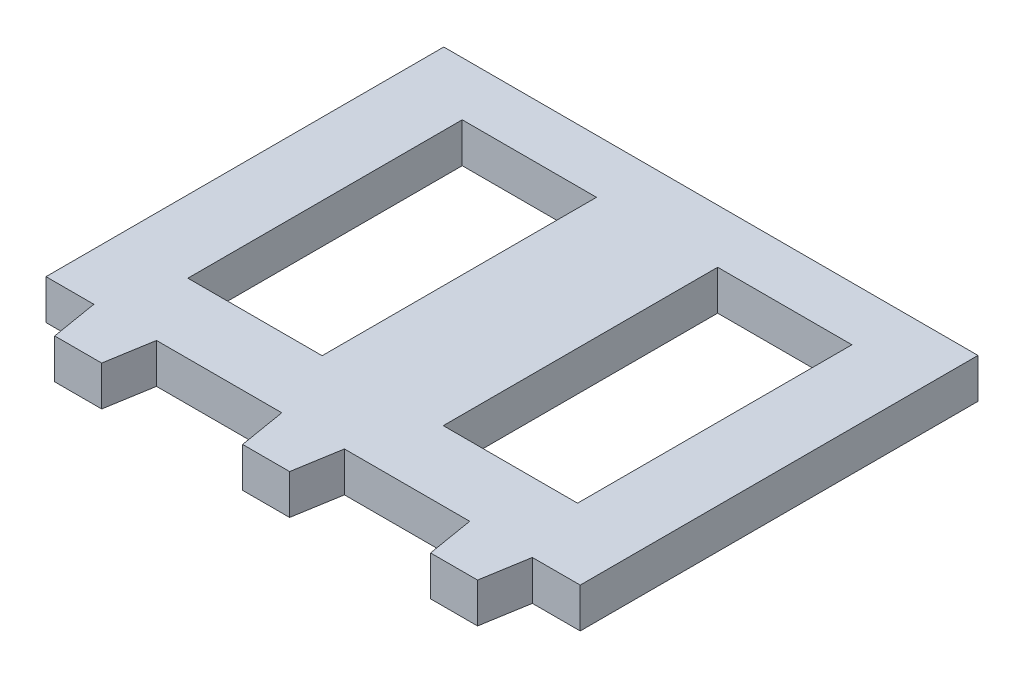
from build123d import *

# Parameters (mm, degrees)
SKETCH2_W           = 85.279590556
SKETCH2_H           = 63.5
SKETCH2_W_2         = 21.432451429
SKETCH2_H_2         = 43.79853014
BOSS_EXTRUDE1_DEPTH = 6.35


with BuildPart() as part:
    # Sketch2 → Boss-Extrude1 (new body)
    # profile 1 of 6: a face of its own
    with BuildSketch(Plane(origin=(0, 0, 0), x_dir=(1, 0, 0), z_dir=(0, 1, 0))):
        Rectangle(SKETCH2_W, SKETCH2_H)
        with Locations((-20.38588495, 1.25966445)):
            Rectangle(SKETCH2_W_2, SKETCH2_H_2, mode=Mode.SUBTRACT)
        with Locations((20.38588495, 1.25966445)):
            Rectangle(SKETCH2_W_2, SKETCH2_H_2, mode=Mode.SUBTRACT)
    # profile 2 of 6: a face of its own
    with BuildSketch(Plane(origin=(0, 0, 0), x_dir=(1, 0, 0), z_dir=(0, 1, 0))):
        Polygon((-25, -31.75), (-35, -31.75), (-33.75, -39.25), (-26.25, -39.25), align=None)
    # profile 3 of 6: a face of its own
    with BuildSketch(Plane(origin=(0, 0, 0), x_dir=(1, 0, 0), z_dir=(0, 1, 0))):
        Polygon((-25, -31.75), (-35, -31.75), (-33.75, -39.25), (-26.25, -39.25), align=None)
    # profile 4 of 6: a face of its own
    with BuildSketch(Plane(origin=(0, 0, 0), x_dir=(1, 0, 0), z_dir=(0, 1, 0))):
        Polygon((5, -31.75), (-5, -31.75), (-3.75, -39.25), (3.75, -39.25), align=None)
    # profile 5 of 6: a face of its own
    with BuildSketch(Plane(origin=(0, 0, 0), x_dir=(1, 0, 0), z_dir=(0, 1, 0))):
        Polygon((33.75, -39.25), (35, -31.75), (25, -31.75), (26.25, -39.25), align=None)
    # profile 6 of 6: a face of its own
    with BuildSketch(Plane(origin=(0, 0, 0), x_dir=(1, 0, 0), z_dir=(0, 1, 0))):
        Polygon((33.75, -39.25), (35, -31.75), (25, -31.75), (26.25, -39.25), align=None)
    extrude(amount=BOSS_EXTRUDE1_DEPTH)


solid = part.part
